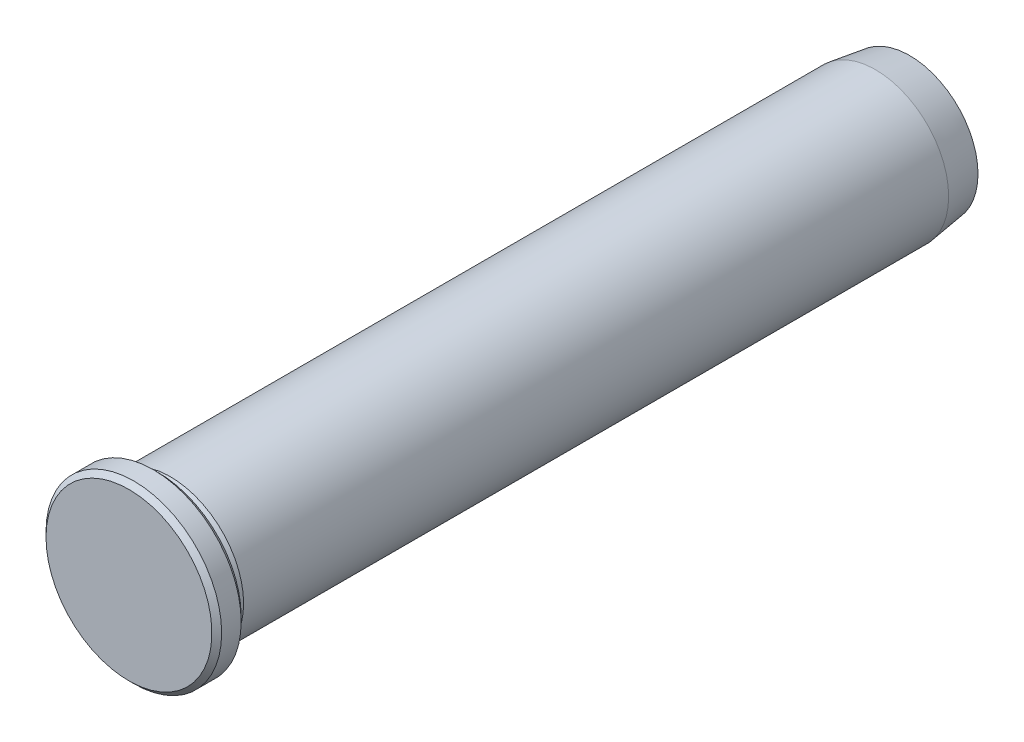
ISO-10303-21;
HEADER;
FILE_DESCRIPTION(('STEP AP214'),'2;1');
FILE_NAME('part.step','',(''),(''),'','','');
FILE_SCHEMA(('AUTOMOTIVE_DESIGN { 1 0 10303 214 1 1 1 1 }'));
ENDSEC;
DATA;
#1=APPLICATION_CONTEXT('core data for automotive mechanical design processes');
#2=APPLICATION_PROTOCOL_DEFINITION('international standard','automotive_design',2000,#1);
#3=PRODUCT_CONTEXT('',#1,'mechanical');
#4=PRODUCT('Part','Part','',(#3));
#5=PRODUCT_RELATED_PRODUCT_CATEGORY('part','',(#4));
#6=PRODUCT_DEFINITION_FORMATION('','',#4);
#7=PRODUCT_DEFINITION_CONTEXT('part definition',#1,'design');
#8=PRODUCT_DEFINITION('design','',#6,#7);
#9=PRODUCT_DEFINITION_SHAPE('','',#8);
#10=(LENGTH_UNIT() NAMED_UNIT(*) SI_UNIT(.MILLI.,.METRE.));
#11=(NAMED_UNIT(*) PLANE_ANGLE_UNIT() SI_UNIT($,.RADIAN.));
#12=(NAMED_UNIT(*) SI_UNIT($,.STERADIAN.) SOLID_ANGLE_UNIT());
#13=UNCERTAINTY_MEASURE_WITH_UNIT(LENGTH_MEASURE(1.E-05),#10,'distance_accuracy_value','');
#14=(GEOMETRIC_REPRESENTATION_CONTEXT(3) GLOBAL_UNCERTAINTY_ASSIGNED_CONTEXT((#13)) GLOBAL_UNIT_ASSIGNED_CONTEXT((#10,
#11,#12)) REPRESENTATION_CONTEXT('',''));
#15=CARTESIAN_POINT('',(0.,0.,0.));
#16=DIRECTION('',(0.,0.,1.));
#17=DIRECTION('',(1.,0.,0.));
#18=AXIS2_PLACEMENT_3D('',#15,#16,#17);
#19=CARTESIAN_POINT('',(0.,0.,0.));
#20=DIRECTION('',(0.,0.,-1.));
#21=DIRECTION('',(-1.,0.,0.));
#22=AXIS2_PLACEMENT_3D('',#19,#20,#21);
#23=PLANE('',#22);
#24=CARTESIAN_POINT('',(0.,0.,0.));
#25=DIRECTION('',(0.,0.,-1.));
#26=DIRECTION('',(-1.,0.,0.));
#27=AXIS2_PLACEMENT_3D('',#24,#25,#26);
#28=CIRCLE('',#27,17.);
#29=CARTESIAN_POINT('',(-17.,0.,0.));
#30=VERTEX_POINT('',#29);
#31=EDGE_CURVE('E9',#30,#30,#28,.F.);
#32=ORIENTED_EDGE('',*,*,#31,.T.);
#33=EDGE_LOOP('',(#32));
#34=FACE_BOUND('',#33,.T.);
#35=ADVANCED_FACE('F14',(#34),#23,.F.);
#36=CARTESIAN_POINT('',(0.,0.,0.));
#37=DIRECTION('',(0.,0.,1.));
#38=DIRECTION('',(1.,0.,0.));
#39=AXIS2_PLACEMENT_3D('',#36,#37,#38);
#40=CYLINDRICAL_SURFACE('',#39,18.);
#41=CARTESIAN_POINT('',(0.,0.,-5.));
#42=DIRECTION('',(0.,0.,1.));
#43=DIRECTION('',(1.,0.,0.));
#44=AXIS2_PLACEMENT_3D('',#41,#42,#43);
#45=CIRCLE('',#44,18.);
#46=CARTESIAN_POINT('',(18.,0.,-5.));
#47=VERTEX_POINT('',#46);
#48=EDGE_CURVE('E25',#47,#47,#45,.T.);
#49=ORIENTED_EDGE('',*,*,#48,.T.);
#50=EDGE_LOOP('',(#49));
#51=FACE_BOUND('',#50,.T.);
#52=CARTESIAN_POINT('',(0.,0.,-1.));
#53=DIRECTION('',(0.,0.,-1.));
#54=DIRECTION('',(-1.,0.,0.));
#55=AXIS2_PLACEMENT_3D('',#52,#53,#54);
#56=CIRCLE('',#55,18.);
#57=CARTESIAN_POINT('',(-18.,0.,-1.));
#58=VERTEX_POINT('',#57);
#59=EDGE_CURVE('E29',#58,#58,#56,.T.);
#60=ORIENTED_EDGE('',*,*,#59,.T.);
#61=EDGE_LOOP('',(#60));
#62=FACE_BOUND('',#61,.T.);
#63=ADVANCED_FACE('F73',(#51,#62),#40,.T.);
#64=CARTESIAN_POINT('',(0.,18.,-6.));
#65=DIRECTION('',(0.,0.,1.));
#66=DIRECTION('',(1.,0.,0.));
#67=AXIS2_PLACEMENT_3D('',#64,#65,#66);
#68=PLANE('',#67);
#69=CARTESIAN_POINT('',(0.,0.,-6.));
#70=DIRECTION('',(0.,0.,1.));
#71=DIRECTION('',(1.,0.,0.));
#72=AXIS2_PLACEMENT_3D('',#69,#70,#71);
#73=CIRCLE('',#72,17.);
#74=CARTESIAN_POINT('',(17.,0.,-6.));
#75=VERTEX_POINT('',#74);
#76=EDGE_CURVE('E21',#75,#75,#73,.F.);
#77=ORIENTED_EDGE('',*,*,#76,.T.);
#78=EDGE_LOOP('',(#77));
#79=FACE_BOUND('',#78,.T.);
#80=CARTESIAN_POINT('',(0.,0.,-6.));
#81=DIRECTION('',(0.,0.,1.));
#82=DIRECTION('',(1.,0.,0.));
#83=AXIS2_PLACEMENT_3D('',#80,#81,#82);
#84=CIRCLE('',#83,15.5);
#85=CARTESIAN_POINT('',(15.5,0.,-6.));
#86=VERTEX_POINT('',#85);
#87=EDGE_CURVE('E34',#86,#86,#84,.T.);
#88=ORIENTED_EDGE('',*,*,#87,.T.);
#89=EDGE_LOOP('',(#88));
#90=FACE_BOUND('',#89,.T.);
#91=ADVANCED_FACE('F79',(#79,#90),#68,.F.);
#92=CARTESIAN_POINT('',(0.,0.,-6.8));
#93=DIRECTION('',(0.,0.,1.));
#94=DIRECTION('',(1.,0.,0.));
#95=AXIS2_PLACEMENT_3D('',#92,#93,#94);
#96=TOROIDAL_SURFACE('',#95,15.5,0.8);
#97=ORIENTED_EDGE('',*,*,#87,.F.);
#98=EDGE_LOOP('',(#97));
#99=FACE_BOUND('',#98,.T.);
#100=CARTESIAN_POINT('',(0.,0.,-6.8));
#101=DIRECTION('',(0.,0.,1.));
#102=DIRECTION('',(1.,0.,0.));
#103=AXIS2_PLACEMENT_3D('',#100,#101,#102);
#104=CIRCLE('',#103,14.7);
#105=CARTESIAN_POINT('',(14.7,0.,-6.8));
#106=VERTEX_POINT('',#105);
#107=EDGE_CURVE('E37',#106,#106,#104,.T.);
#108=ORIENTED_EDGE('',*,*,#107,.T.);
#109=EDGE_LOOP('',(#108));
#110=FACE_BOUND('',#109,.T.);
#111=ADVANCED_FACE('F85',(#99,#110),#96,.F.);
#112=CARTESIAN_POINT('',(0.,0.,0.));
#113=DIRECTION('',(0.,0.,1.));
#114=DIRECTION('',(1.,0.,0.));
#115=AXIS2_PLACEMENT_3D('',#112,#113,#114);
#116=CYLINDRICAL_SURFACE('',#115,14.7);
#117=ORIENTED_EDGE('',*,*,#107,.F.);
#118=EDGE_LOOP('',(#117));
#119=FACE_BOUND('',#118,.T.);
#120=CARTESIAN_POINT('',(0.,0.,-7.27506275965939));
#121=DIRECTION('',(0.,0.,1.));
#122=DIRECTION('',(1.,0.,0.));
#123=AXIS2_PLACEMENT_3D('',#120,#121,#122);
#124=CIRCLE('',#123,14.7);
#125=CARTESIAN_POINT('',(14.7,0.,-7.27506275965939));
#126=VERTEX_POINT('',#125);
#127=EDGE_CURVE('E40',#126,#126,#124,.T.);
#128=ORIENTED_EDGE('',*,*,#127,.T.);
#129=EDGE_LOOP('',(#128));
#130=FACE_BOUND('',#129,.T.);
#131=ADVANCED_FACE('F88',(#119,#130),#116,.T.);
#132=CARTESIAN_POINT('',(0.,0.,-7.27506275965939));
#133=DIRECTION('',(0.,0.,1.));
#134=DIRECTION('',(1.,0.,0.));
#135=AXIS2_PLACEMENT_3D('',#132,#133,#134);
#136=TOROIDAL_SURFACE('',#135,15.5,0.8);
#137=ORIENTED_EDGE('',*,*,#127,.F.);
#138=EDGE_LOOP('',(#137));
#139=FACE_BOUND('',#138,.T.);
#140=CARTESIAN_POINT('',(0.,0.,-7.48211799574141));
#141=DIRECTION('',(0.,0.,1.));
#142=DIRECTION('',(1.,0.,0.));
#143=AXIS2_PLACEMENT_3D('',#140,#141,#142);
#144=CIRCLE('',#143,14.7272593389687);
#145=CARTESIAN_POINT('',(14.7272593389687,0.,-7.48211799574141));
#146=VERTEX_POINT('',#145);
#147=EDGE_CURVE('E43',#146,#146,#144,.T.);
#148=ORIENTED_EDGE('',*,*,#147,.T.);
#149=EDGE_LOOP('',(#148));
#150=FACE_BOUND('',#149,.T.);
#151=ADVANCED_FACE('F92',(#139,#150),#136,.F.);
#152=CARTESIAN_POINT('',(0.,0.,-8.5));
#153=DIRECTION('',(0.,0.,-1.));
#154=DIRECTION('',(-1.,0.,0.));
#155=AXIS2_PLACEMENT_3D('',#152,#153,#154);
#156=CONICAL_SURFACE('',#155,15.,0.261799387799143);
#157=ORIENTED_EDGE('',*,*,#147,.F.);
#158=EDGE_LOOP('',(#157));
#159=FACE_BOUND('',#158,.T.);
#160=CARTESIAN_POINT('',(0.,0.,-8.5));
#161=DIRECTION('',(0.,0.,1.));
#162=DIRECTION('',(1.,0.,0.));
#163=AXIS2_PLACEMENT_3D('',#160,#161,#162);
#164=CIRCLE('',#163,15.);
#165=CARTESIAN_POINT('',(15.,0.,-8.5));
#166=VERTEX_POINT('',#165);
#167=EDGE_CURVE('E46',#166,#166,#164,.T.);
#168=ORIENTED_EDGE('',*,*,#167,.T.);
#169=EDGE_LOOP('',(#168));
#170=FACE_BOUND('',#169,.T.);
#171=ADVANCED_FACE('F96',(#159,#170),#156,.T.);
#172=CARTESIAN_POINT('',(0.,0.,0.));
#173=DIRECTION('',(0.,0.,1.));
#174=DIRECTION('',(1.,0.,0.));
#175=AXIS2_PLACEMENT_3D('',#172,#173,#174);
#176=CYLINDRICAL_SURFACE('',#175,15.);
#177=ORIENTED_EDGE('',*,*,#167,.F.);
#178=EDGE_LOOP('',(#177));
#179=FACE_BOUND('',#178,.T.);
#180=CARTESIAN_POINT('',(0.,0.,-153.));
#181=DIRECTION('',(0.,0.,1.));
#182=DIRECTION('',(1.,0.,0.));
#183=AXIS2_PLACEMENT_3D('',#180,#181,#182);
#184=CIRCLE('',#183,15.);
#185=CARTESIAN_POINT('',(15.,0.,-153.));
#186=VERTEX_POINT('',#185);
#187=EDGE_CURVE('E49',#186,#186,#184,.T.);
#188=ORIENTED_EDGE('',*,*,#187,.T.);
#189=EDGE_LOOP('',(#188));
#190=FACE_BOUND('',#189,.T.);
#191=ADVANCED_FACE('F69',(#179,#190),#176,.T.);
#192=CARTESIAN_POINT('',(0.,0.,-160.));
#193=DIRECTION('',(0.,0.,1.));
#194=DIRECTION('',(1.,0.,0.));
#195=AXIS2_PLACEMENT_3D('',#192,#193,#194);
#196=CONICAL_SURFACE('',#195,14.0162141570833,0.13962634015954);
#197=ORIENTED_EDGE('',*,*,#187,.F.);
#198=EDGE_LOOP('',(#197));
#199=FACE_BOUND('',#198,.T.);
#200=CARTESIAN_POINT('',(0.,0.,-160.));
#201=DIRECTION('',(0.,0.,1.));
#202=DIRECTION('',(1.,0.,0.));
#203=AXIS2_PLACEMENT_3D('',#200,#201,#202);
#204=CIRCLE('',#203,14.0162141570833);
#205=CARTESIAN_POINT('',(14.0162141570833,0.,-160.));
#206=VERTEX_POINT('',#205);
#207=EDGE_CURVE('E52',#206,#206,#204,.T.);
#208=ORIENTED_EDGE('',*,*,#207,.T.);
#209=EDGE_LOOP('',(#208));
#210=FACE_BOUND('',#209,.T.);
#211=ADVANCED_FACE('F56',(#199,#210),#196,.T.);
#212=CARTESIAN_POINT('',(0.,14.0162141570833,-160.));
#213=DIRECTION('',(0.,0.,1.));
#214=DIRECTION('',(1.,0.,0.));
#215=AXIS2_PLACEMENT_3D('',#212,#213,#214);
#216=PLANE('',#215);
#217=ORIENTED_EDGE('',*,*,#207,.F.);
#218=EDGE_LOOP('',(#217));
#219=FACE_BOUND('',#218,.T.);
#220=ADVANCED_FACE('F58',(#219),#216,.F.);
#221=CARTESIAN_POINT('',(0.,0.,-5.));
#222=DIRECTION('',(0.,0.,1.));
#223=DIRECTION('',(1.,0.,0.));
#224=AXIS2_PLACEMENT_3D('',#221,#222,#223);
#225=CONICAL_SURFACE('',#224,18.,0.785398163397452);
#226=ORIENTED_EDGE('',*,*,#76,.F.);
#227=EDGE_LOOP('',(#226));
#228=FACE_BOUND('',#227,.T.);
#229=ORIENTED_EDGE('',*,*,#48,.F.);
#230=EDGE_LOOP('',(#229));
#231=FACE_BOUND('',#230,.T.);
#232=ADVANCED_FACE('F60',(#228,#231),#225,.T.);
#233=CARTESIAN_POINT('',(0.,0.,0.));
#234=DIRECTION('',(0.,0.,-1.));
#235=DIRECTION('',(-1.,0.,0.));
#236=AXIS2_PLACEMENT_3D('',#233,#234,#235);
#237=CONICAL_SURFACE('',#236,17.,0.785398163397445);
#238=ORIENTED_EDGE('',*,*,#59,.F.);
#239=EDGE_LOOP('',(#238));
#240=FACE_BOUND('',#239,.T.);
#241=ORIENTED_EDGE('',*,*,#31,.F.);
#242=EDGE_LOOP('',(#241));
#243=FACE_BOUND('',#242,.T.);
#244=ADVANCED_FACE('F16',(#240,#243),#237,.T.);
#245=CLOSED_SHELL('',(#35,#63,#91,#111,#131,#151,#171,#191,#211,#220,#232,#244));
#246=MANIFOLD_SOLID_BREP('B1',#245);
#247=ADVANCED_BREP_SHAPE_REPRESENTATION('',(#18,#246),#14);
#248=SHAPE_DEFINITION_REPRESENTATION(#9,#247);
ENDSEC;
END-ISO-10303-21;
